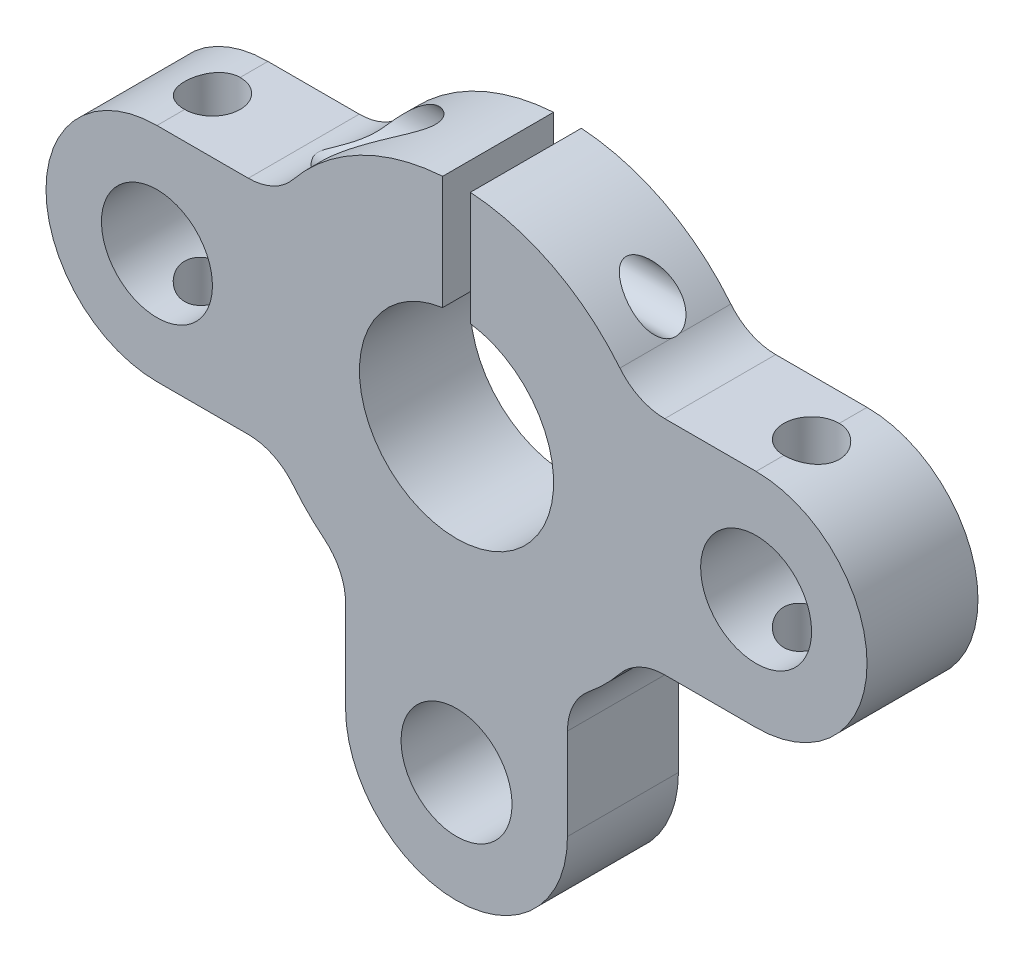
from build123d import *

# Parameters (mm, degrees)
SKETCH1_R                   = 24.0665
SKETCH1_R_2                 = 11.1125
BOSS_EXTRUDE1_DEPTH         = 12.7
SKETCH2_W                   = 3.175
SKETCH2_H                   = 25.4
CUT_EXTRUDE1_DEPTH          = 37.327439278
SKETCH7_R                   = 6.35
BOSS_EXTRUDE4_DEPTH         = 12.7
CIRPATTERN1_COUNT           = 2
CIRPATTERN1_ANGLE           = 90
CIRPATTERN2_COPY_1_SKETCH_R = 6.35
CIRPATTERN2_COPY_1_DEPTH    = 12.7
CIRPATTERN2_COPY_2_SKETCH_R = 6.35
CIRPATTERN2_COPY_2_DEPTH    = 12.7
SKETCH8_R                   = 3.175
CUT_EXTRUDE5_DEPTH          = 78.021076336
FILLET1_R                   = 6.604
SKETCH12_W                  = 2.5527
SKETCH12_H                  = 45.4025
SKETCH13_R                  = 3.175
CUT_EXTRUDE6_DEPTH          = 2.54
SKETCH16_R                  = 4.7625
CUT_EXTRUDE7_DEPTH          = 71.58575578


with BuildPart() as part:
    # Sketch1 → Boss-Extrude1 (new body)
    with BuildSketch(Plane.XY):
        Circle(SKETCH1_R)
        Circle(SKETCH1_R_2, mode=Mode.SUBTRACT)
    extrude(amount=BOSS_EXTRUDE1_DEPTH)

    # Sketch2 → Cut-Extrude1 (cut, through all)
    with BuildSketch(Plane.XY.offset(12.7)):
        with Locations((0, 12.7)):
            Rectangle(SKETCH2_W, SKETCH2_H)
    extrude(amount=-CUT_EXTRUDE1_DEPTH, mode=Mode.SUBTRACT)

    # Sketch7 → Boss-Extrude4 (add)
    with BuildSketch(Plane(origin=(0, 0, 0), x_dir=(-1, 0, 0), z_dir=(0, 0, -1))):
        with BuildLine():
            Line((-12.7, -34.29), (-12.7, -20.442759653))
            Line((-12.7, -20.442759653), (12.7, -20.442759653))
            Line((12.7, -20.442759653), (12.7, -34.29))
            ThreePointArc((12.7, -34.29), (0, -46.99), (-12.7, -34.29))
        make_face()
        with Locations((0, -34.29)):
            Circle(SKETCH7_R, mode=Mode.SUBTRACT)
    boss_extrude4 = extrude(amount=-BOSS_EXTRUDE4_DEPTH)

    # CirPattern1: Boss-Extrude4 ×2 about axis
    cirpattern1_axis = Axis((0, 0, 0), (0, 0, 1))
    for i in range(1, CIRPATTERN1_COUNT):
        add(boss_extrude4.rotate(cirpattern1_axis, i * CIRPATTERN1_ANGLE / (CIRPATTERN1_COUNT - 1)))

    # CirPattern2 copy 1 sketch → CirPattern2 copy 1 (add)
    with BuildSketch(Plane(origin=(0, 0, 0), x_dir=(-1, 0, 0), z_dir=(0, 0, -1))):
        with BuildLine():
            Line((-12.7, -34.29), (-12.7, -20.442759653))
            Line((-12.7, -20.442759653), (12.7, -20.442759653))
            Line((12.7, -20.442759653), (12.7, -34.29))
            ThreePointArc((12.7, -34.29), (0, -46.99), (-12.7, -34.29))
        make_face()
        with Locations((0, -34.29)):
            Circle(CIRPATTERN2_COPY_1_SKETCH_R, mode=Mode.SUBTRACT)
    extrude(amount=-CIRPATTERN2_COPY_1_DEPTH)

    # CirPattern2 copy 2 sketch → CirPattern2 copy 2 (add)
    with BuildSketch(Plane.YX):
        with BuildLine():
            Line((-12.7, -34.29), (-12.7, -20.442759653))
            Line((-12.7, -20.442759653), (12.7, -20.442759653))
            Line((12.7, -20.442759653), (12.7, -34.29))
            ThreePointArc((12.7, -34.29), (0, -46.99), (-12.7, -34.29))
        make_face()
        with Locations((0, -34.29)):
            Circle(CIRPATTERN2_COPY_2_SKETCH_R, mode=Mode.SUBTRACT)
    extrude(amount=-CIRPATTERN2_COPY_2_DEPTH)

    # Sketch8 → Cut-Extrude5 (cut, through all)
    with BuildSketch(Plane(origin=(0, 12.7, 0), x_dir=(1, 0, 0), z_dir=(0, 1, 0))):
        with Locations(Location((34.29, -6.35, 0), (0, 0, 180))):
            Circle(SKETCH8_R)
        with Locations(Location((-34.29, -6.35, 0), (0, 0, 180))):
            Circle(SKETCH8_R)
    extrude(amount=-CUT_EXTRUDE5_DEPTH, mode=Mode.SUBTRACT)

    # Fillet1
    fillet1_edges = [part.edges().sort_by_distance(p)[0] for p in [
        (12.7, -20.442759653, 6.35),
        (-12.7, -20.442759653, 6.35),
        (20.442759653, 12.7, 6.35),
        (20.442759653, -12.7, 6.35),
        (-20.442759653, -12.7, 6.35),
        (-20.442759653, 12.7, 6.35),
    ]]
    fillet(fillet1_edges, radius=FILLET1_R)

    # Sketch12 → 1_4-20 Tapped Hole1 (revolve, cut)
    with BuildSketch(Plane(origin=(1.5875, 17.664084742, 6.35), x_dir=(0, 0, 1), z_dir=(0, 1, 0))):
        with Locations((1.27635, 22.70125)):
            Rectangle(SKETCH12_W, SKETCH12_H)
    revolve(axis=Axis((-4.7625, 17.664084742, 6.35), (1, 0, 0)), mode=Mode.SUBTRACT)

    # Sketch13 → Cut-Extrude6 (cut)
    with BuildSketch(Plane(origin=(-1.5875, 0, 0), x_dir=(0, 0, -1), z_dir=(1, 0, 0))):
        with Locations((-6.35, 17.664084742)):
            Circle(SKETCH13_R)
    extrude(amount=-CUT_EXTRUDE6_DEPTH, mode=Mode.SUBTRACT)

    # Sketch16 → Cut-Extrude7 (cut, through all)
    with BuildSketch(Plane(origin=(-4.1275, 0, 0), x_dir=(0, 0, -1), z_dir=(1, 0, 0))):
        with Locations((-6.35, 17.664084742)):
            Circle(SKETCH16_R)
    extrude(amount=-CUT_EXTRUDE7_DEPTH, mode=Mode.SUBTRACT)


solid = part.part
